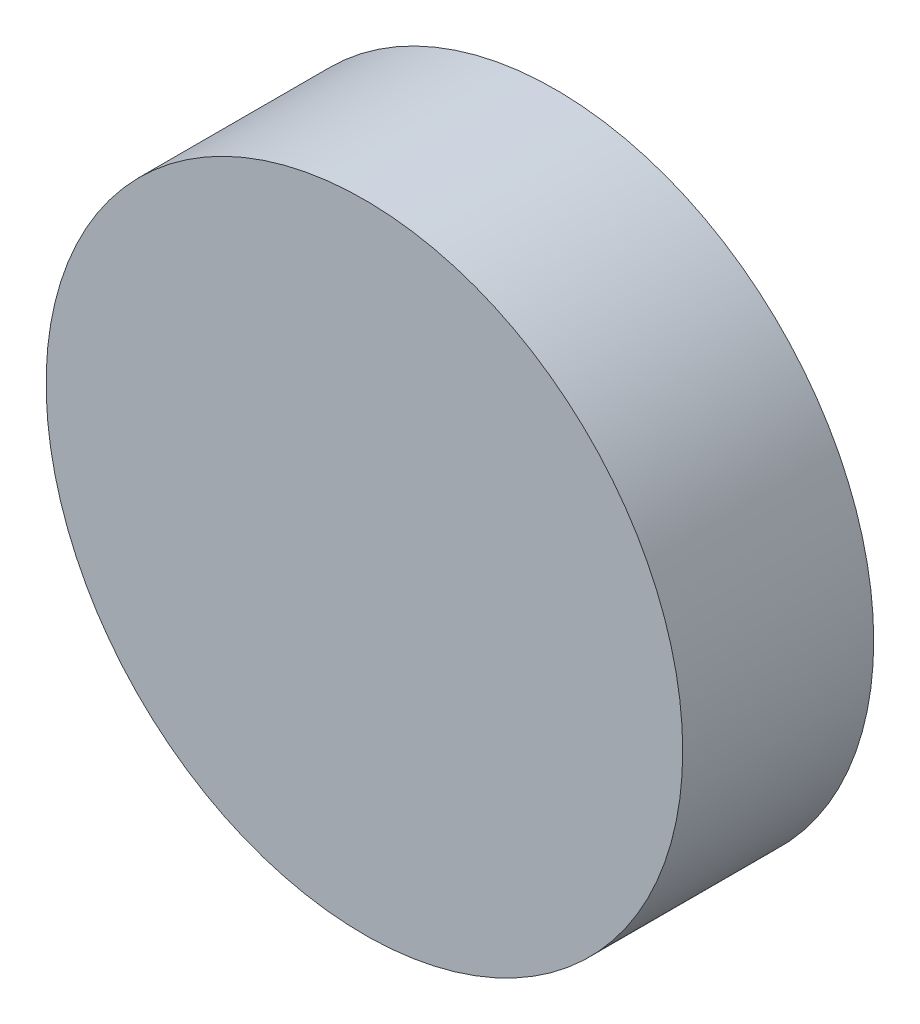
from build123d import *

# Parameters (mm, degrees)
SKIZZE1_R               = 20
LINEAR_AUSTRAGEN1_DEPTH = 12


with BuildPart() as part:
    # Skizze1 → Linear austragen1 (new body)
    with BuildSketch(Plane.XY):
        Circle(SKIZZE1_R)
    extrude(amount=-LINEAR_AUSTRAGEN1_DEPTH)


solid = part.part
